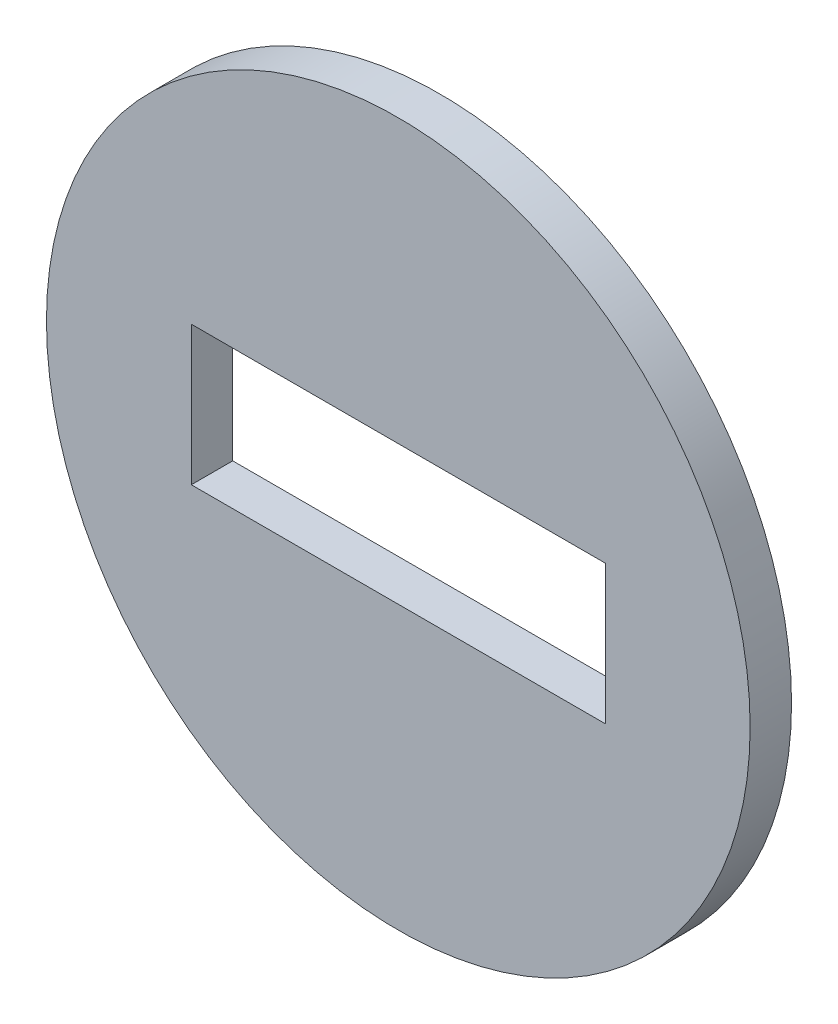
ISO-10303-21;
HEADER;
FILE_DESCRIPTION(('STEP AP214'),'2;1');
FILE_NAME('part.step','',(''),(''),'','','');
FILE_SCHEMA(('AUTOMOTIVE_DESIGN { 1 0 10303 214 1 1 1 1 }'));
ENDSEC;
DATA;
#1=APPLICATION_CONTEXT('core data for automotive mechanical design processes');
#2=APPLICATION_PROTOCOL_DEFINITION('international standard','automotive_design',2000,#1);
#3=PRODUCT_CONTEXT('',#1,'mechanical');
#4=PRODUCT('Part','Part','',(#3));
#5=PRODUCT_RELATED_PRODUCT_CATEGORY('part','',(#4));
#6=PRODUCT_DEFINITION_FORMATION('','',#4);
#7=PRODUCT_DEFINITION_CONTEXT('part definition',#1,'design');
#8=PRODUCT_DEFINITION('design','',#6,#7);
#9=PRODUCT_DEFINITION_SHAPE('','',#8);
#10=(LENGTH_UNIT() NAMED_UNIT(*) SI_UNIT(.MILLI.,.METRE.));
#11=(NAMED_UNIT(*) PLANE_ANGLE_UNIT() SI_UNIT($,.RADIAN.));
#12=(NAMED_UNIT(*) SI_UNIT($,.STERADIAN.) SOLID_ANGLE_UNIT());
#13=UNCERTAINTY_MEASURE_WITH_UNIT(LENGTH_MEASURE(1.E-05),#10,'distance_accuracy_value','');
#14=(GEOMETRIC_REPRESENTATION_CONTEXT(3) GLOBAL_UNCERTAINTY_ASSIGNED_CONTEXT((#13)) GLOBAL_UNIT_ASSIGNED_CONTEXT((#10,
#11,#12)) REPRESENTATION_CONTEXT('',''));
#15=CARTESIAN_POINT('',(0.,0.,0.));
#16=DIRECTION('',(0.,0.,1.));
#17=DIRECTION('',(1.,0.,0.));
#18=AXIS2_PLACEMENT_3D('',#15,#16,#17);
#19=CARTESIAN_POINT('',(0.,0.,3.175));
#20=DIRECTION('',(0.,0.,-1.));
#21=DIRECTION('',(-1.,0.,0.));
#22=AXIS2_PLACEMENT_3D('',#19,#20,#21);
#23=CYLINDRICAL_SURFACE('',#22,26.9875);
#24=CARTESIAN_POINT('',(0.,0.,3.175));
#25=DIRECTION('',(0.,0.,1.));
#26=DIRECTION('',(1.,0.,0.));
#27=AXIS2_PLACEMENT_3D('',#24,#25,#26);
#28=CIRCLE('',#27,26.9875);
#29=CARTESIAN_POINT('',(26.9875,0.,3.175));
#30=VERTEX_POINT('',#29);
#31=EDGE_CURVE('E11',#30,#30,#28,.T.);
#32=ORIENTED_EDGE('',*,*,#31,.F.);
#33=EDGE_LOOP('',(#32));
#34=FACE_BOUND('',#33,.T.);
#35=CARTESIAN_POINT('',(0.,0.,0.));
#36=DIRECTION('',(0.,0.,1.));
#37=DIRECTION('',(1.,0.,0.));
#38=AXIS2_PLACEMENT_3D('',#35,#36,#37);
#39=CIRCLE('',#38,26.9875);
#40=CARTESIAN_POINT('',(26.9875,0.,0.));
#41=VERTEX_POINT('',#40);
#42=EDGE_CURVE('E38',#41,#41,#39,.T.);
#43=ORIENTED_EDGE('',*,*,#42,.T.);
#44=EDGE_LOOP('',(#43));
#45=FACE_BOUND('',#44,.T.);
#46=ADVANCED_FACE('F31',(#34,#45),#23,.T.);
#47=CARTESIAN_POINT('',(0.,0.,3.175));
#48=DIRECTION('',(0.,0.,1.));
#49=DIRECTION('',(1.,0.,0.));
#50=AXIS2_PLACEMENT_3D('',#47,#48,#49);
#51=PLANE('',#50);
#52=DIRECTION('',(0.,-1.,0.));
#53=VECTOR('',#52,1.);
#54=CARTESIAN_POINT('',(-15.875,5.334,3.175));
#55=LINE('',#54,#53);
#56=CARTESIAN_POINT('',(-15.875,5.334,3.175));
#57=VERTEX_POINT('',#56);
#58=CARTESIAN_POINT('',(-15.875,-5.334,3.175));
#59=VERTEX_POINT('',#58);
#60=EDGE_CURVE('E45',#57,#59,#55,.T.);
#61=ORIENTED_EDGE('',*,*,#60,.F.);
#62=DIRECTION('',(-1.,0.,0.));
#63=VECTOR('',#62,1.);
#64=CARTESIAN_POINT('',(-15.875,5.334,3.175));
#65=LINE('',#64,#63);
#66=CARTESIAN_POINT('',(15.875,5.334,3.175));
#67=VERTEX_POINT('',#66);
#68=EDGE_CURVE('E89',#67,#57,#65,.T.);
#69=ORIENTED_EDGE('',*,*,#68,.F.);
#70=DIRECTION('',(0.,1.,0.));
#71=VECTOR('',#70,1.);
#72=CARTESIAN_POINT('',(15.875,5.334,3.175));
#73=LINE('',#72,#71);
#74=CARTESIAN_POINT('',(15.875,-5.334,3.175));
#75=VERTEX_POINT('',#74);
#76=EDGE_CURVE('E73',#75,#67,#73,.T.);
#77=ORIENTED_EDGE('',*,*,#76,.F.);
#78=DIRECTION('',(1.,0.,0.));
#79=VECTOR('',#78,1.);
#80=CARTESIAN_POINT('',(-15.875,-5.334,3.175));
#81=LINE('',#80,#79);
#82=EDGE_CURVE('E82',#59,#75,#81,.T.);
#83=ORIENTED_EDGE('',*,*,#82,.F.);
#84=EDGE_LOOP('',(#61,#69,#77,#83));
#85=FACE_BOUND('',#84,.T.);
#86=ORIENTED_EDGE('',*,*,#31,.T.);
#87=EDGE_LOOP('',(#86));
#88=FACE_BOUND('',#87,.T.);
#89=ADVANCED_FACE('F86',(#85,#88),#51,.T.);
#90=CARTESIAN_POINT('',(0.,0.,0.));
#91=DIRECTION('',(0.,0.,1.));
#92=DIRECTION('',(1.,0.,0.));
#93=AXIS2_PLACEMENT_3D('',#90,#91,#92);
#94=PLANE('',#93);
#95=DIRECTION('',(-1.,0.,0.));
#96=VECTOR('',#95,1.);
#97=CARTESIAN_POINT('',(-15.875,5.334,0.));
#98=LINE('',#97,#96);
#99=CARTESIAN_POINT('',(15.875,5.334,0.));
#100=VERTEX_POINT('',#99);
#101=CARTESIAN_POINT('',(-15.875,5.334,0.));
#102=VERTEX_POINT('',#101);
#103=EDGE_CURVE('E100',#100,#102,#98,.T.);
#104=ORIENTED_EDGE('',*,*,#103,.T.);
#105=DIRECTION('',(0.,-1.,0.));
#106=VECTOR('',#105,1.);
#107=CARTESIAN_POINT('',(-15.875,5.334,0.));
#108=LINE('',#107,#106);
#109=CARTESIAN_POINT('',(-15.875,-5.334,0.));
#110=VERTEX_POINT('',#109);
#111=EDGE_CURVE('E91',#102,#110,#108,.T.);
#112=ORIENTED_EDGE('',*,*,#111,.T.);
#113=DIRECTION('',(1.,0.,0.));
#114=VECTOR('',#113,1.);
#115=CARTESIAN_POINT('',(-15.875,-5.334,0.));
#116=LINE('',#115,#114);
#117=CARTESIAN_POINT('',(15.875,-5.334,0.));
#118=VERTEX_POINT('',#117);
#119=EDGE_CURVE('E97',#110,#118,#116,.T.);
#120=ORIENTED_EDGE('',*,*,#119,.T.);
#121=DIRECTION('',(0.,1.,0.));
#122=VECTOR('',#121,1.);
#123=CARTESIAN_POINT('',(15.875,5.334,0.));
#124=LINE('',#123,#122);
#125=EDGE_CURVE('E53',#118,#100,#124,.T.);
#126=ORIENTED_EDGE('',*,*,#125,.T.);
#127=EDGE_LOOP('',(#104,#112,#120,#126));
#128=FACE_BOUND('',#127,.T.);
#129=ORIENTED_EDGE('',*,*,#42,.F.);
#130=EDGE_LOOP('',(#129));
#131=FACE_BOUND('',#130,.T.);
#132=ADVANCED_FACE('F110',(#128,#131),#94,.F.);
#133=CARTESIAN_POINT('',(-15.875,5.334,0.));
#134=DIRECTION('',(-1.,0.,0.));
#135=DIRECTION('',(0.,-1.,0.));
#136=AXIS2_PLACEMENT_3D('',#133,#134,#135);
#137=PLANE('',#136);
#138=ORIENTED_EDGE('',*,*,#60,.T.);
#139=DIRECTION('',(0.,0.,1.));
#140=VECTOR('',#139,1.);
#141=CARTESIAN_POINT('',(-15.875,-5.334,0.));
#142=LINE('',#141,#140);
#143=EDGE_CURVE('E79',#110,#59,#142,.T.);
#144=ORIENTED_EDGE('',*,*,#143,.F.);
#145=ORIENTED_EDGE('',*,*,#111,.F.);
#146=DIRECTION('',(0.,0.,1.));
#147=VECTOR('',#146,1.);
#148=CARTESIAN_POINT('',(-15.875,5.334,0.));
#149=LINE('',#148,#147);
#150=EDGE_CURVE('E103',#102,#57,#149,.T.);
#151=ORIENTED_EDGE('',*,*,#150,.T.);
#152=EDGE_LOOP('',(#138,#144,#145,#151));
#153=FACE_BOUND('',#152,.T.);
#154=ADVANCED_FACE('F112',(#153),#137,.F.);
#155=CARTESIAN_POINT('',(-15.875,5.334,0.));
#156=DIRECTION('',(0.,1.,0.));
#157=DIRECTION('',(0.,0.,1.));
#158=AXIS2_PLACEMENT_3D('',#155,#156,#157);
#159=PLANE('',#158);
#160=ORIENTED_EDGE('',*,*,#68,.T.);
#161=ORIENTED_EDGE('',*,*,#150,.F.);
#162=ORIENTED_EDGE('',*,*,#103,.F.);
#163=DIRECTION('',(0.,0.,1.));
#164=VECTOR('',#163,1.);
#165=CARTESIAN_POINT('',(15.875,5.334,0.));
#166=LINE('',#165,#164);
#167=EDGE_CURVE('E78',#100,#67,#166,.T.);
#168=ORIENTED_EDGE('',*,*,#167,.T.);
#169=EDGE_LOOP('',(#160,#161,#162,#168));
#170=FACE_BOUND('',#169,.T.);
#171=ADVANCED_FACE('F119',(#170),#159,.F.);
#172=CARTESIAN_POINT('',(15.875,5.334,0.));
#173=DIRECTION('',(1.,0.,0.));
#174=DIRECTION('',(0.,1.,0.));
#175=AXIS2_PLACEMENT_3D('',#172,#173,#174);
#176=PLANE('',#175);
#177=ORIENTED_EDGE('',*,*,#76,.T.);
#178=ORIENTED_EDGE('',*,*,#167,.F.);
#179=ORIENTED_EDGE('',*,*,#125,.F.);
#180=DIRECTION('',(0.,0.,1.));
#181=VECTOR('',#180,1.);
#182=CARTESIAN_POINT('',(15.875,-5.334,0.));
#183=LINE('',#182,#181);
#184=EDGE_CURVE('E69',#118,#75,#183,.T.);
#185=ORIENTED_EDGE('',*,*,#184,.T.);
#186=EDGE_LOOP('',(#177,#178,#179,#185));
#187=FACE_BOUND('',#186,.T.);
#188=ADVANCED_FACE('F71',(#187),#176,.F.);
#189=CARTESIAN_POINT('',(-15.875,-5.334,0.));
#190=DIRECTION('',(0.,-1.,0.));
#191=DIRECTION('',(0.,0.,-1.));
#192=AXIS2_PLACEMENT_3D('',#189,#190,#191);
#193=PLANE('',#192);
#194=ORIENTED_EDGE('',*,*,#82,.T.);
#195=ORIENTED_EDGE('',*,*,#184,.F.);
#196=ORIENTED_EDGE('',*,*,#119,.F.);
#197=ORIENTED_EDGE('',*,*,#143,.T.);
#198=EDGE_LOOP('',(#194,#195,#196,#197));
#199=FACE_BOUND('',#198,.T.);
#200=ADVANCED_FACE('F83',(#199),#193,.F.);
#201=CLOSED_SHELL('',(#46,#89,#132,#154,#171,#188,#200));
#202=MANIFOLD_SOLID_BREP('B2',#201);
#203=ADVANCED_BREP_SHAPE_REPRESENTATION('',(#18,#202),#14);
#204=SHAPE_DEFINITION_REPRESENTATION(#9,#203);
ENDSEC;
END-ISO-10303-21;
